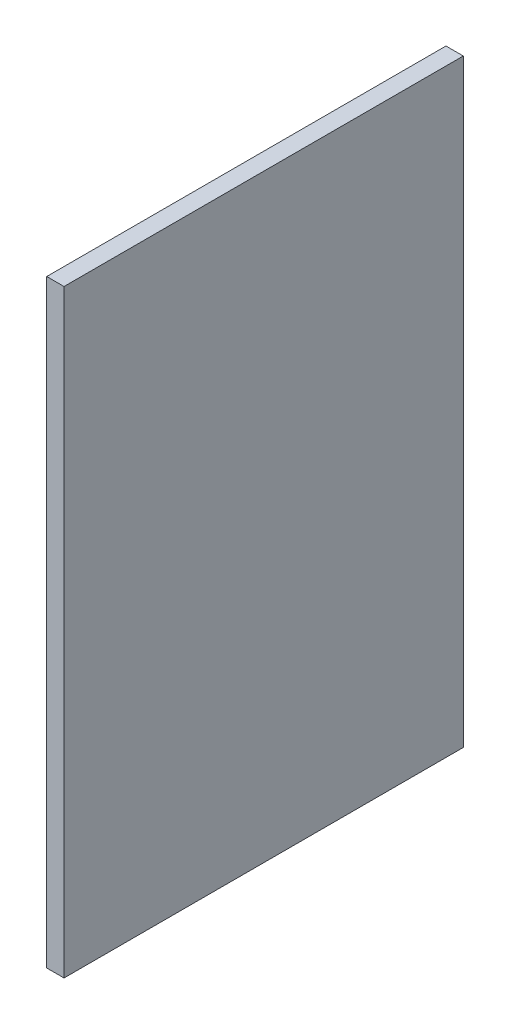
ISO-10303-21;
HEADER;
FILE_DESCRIPTION(('STEP AP214'),'2;1');
FILE_NAME('part.step','',(''),(''),'','','');
FILE_SCHEMA(('AUTOMOTIVE_DESIGN { 1 0 10303 214 1 1 1 1 }'));
ENDSEC;
DATA;
#1=APPLICATION_CONTEXT('core data for automotive mechanical design processes');
#2=APPLICATION_PROTOCOL_DEFINITION('international standard','automotive_design',2000,#1);
#3=PRODUCT_CONTEXT('',#1,'mechanical');
#4=PRODUCT('Part','Part','',(#3));
#5=PRODUCT_RELATED_PRODUCT_CATEGORY('part','',(#4));
#6=PRODUCT_DEFINITION_FORMATION('','',#4);
#7=PRODUCT_DEFINITION_CONTEXT('part definition',#1,'design');
#8=PRODUCT_DEFINITION('design','',#6,#7);
#9=PRODUCT_DEFINITION_SHAPE('','',#8);
#10=(LENGTH_UNIT() NAMED_UNIT(*) SI_UNIT(.MILLI.,.METRE.));
#11=(NAMED_UNIT(*) PLANE_ANGLE_UNIT() SI_UNIT($,.RADIAN.));
#12=(NAMED_UNIT(*) SI_UNIT($,.STERADIAN.) SOLID_ANGLE_UNIT());
#13=UNCERTAINTY_MEASURE_WITH_UNIT(LENGTH_MEASURE(1.E-05),#10,'distance_accuracy_value','');
#14=(GEOMETRIC_REPRESENTATION_CONTEXT(3) GLOBAL_UNCERTAINTY_ASSIGNED_CONTEXT((#13)) GLOBAL_UNIT_ASSIGNED_CONTEXT((#10,
#11,#12)) REPRESENTATION_CONTEXT('',''));
#15=CARTESIAN_POINT('',(0.,0.,0.));
#16=DIRECTION('',(0.,0.,1.));
#17=DIRECTION('',(1.,0.,0.));
#18=AXIS2_PLACEMENT_3D('',#15,#16,#17);
#19=CARTESIAN_POINT('',(3.302,82.55,0.));
#20=DIRECTION('',(0.,0.,-1.));
#21=DIRECTION('',(1.,0.,0.));
#22=AXIS2_PLACEMENT_3D('',#19,#20,#21);
#23=PLANE('',#22);
#24=DIRECTION('',(0.,1.,0.));
#25=VECTOR('',#24,1.);
#26=CARTESIAN_POINT('',(0.,82.55,0.));
#27=LINE('',#26,#25);
#28=CARTESIAN_POINT('',(0.,-31.75,0.));
#29=VERTEX_POINT('',#28);
#30=CARTESIAN_POINT('',(0.,82.55,0.));
#31=VERTEX_POINT('',#30);
#32=EDGE_CURVE('E98',#29,#31,#27,.T.);
#33=ORIENTED_EDGE('',*,*,#32,.F.);
#34=DIRECTION('',(-1.,0.,0.));
#35=VECTOR('',#34,1.);
#36=CARTESIAN_POINT('',(3.302,-31.75,0.));
#37=LINE('',#36,#35);
#38=CARTESIAN_POINT('',(3.302,-31.75,0.));
#39=VERTEX_POINT('',#38);
#40=EDGE_CURVE('E97',#39,#29,#37,.T.);
#41=ORIENTED_EDGE('',*,*,#40,.F.);
#42=DIRECTION('',(0.,1.,0.));
#43=VECTOR('',#42,1.);
#44=CARTESIAN_POINT('',(3.302,82.55,0.));
#45=LINE('',#44,#43);
#46=CARTESIAN_POINT('',(3.302,82.55,0.));
#47=VERTEX_POINT('',#46);
#48=EDGE_CURVE('E92',#39,#47,#45,.T.);
#49=ORIENTED_EDGE('',*,*,#48,.T.);
#50=DIRECTION('',(-1.,0.,0.));
#51=VECTOR('',#50,1.);
#52=CARTESIAN_POINT('',(3.302,82.55,0.));
#53=LINE('',#52,#51);
#54=EDGE_CURVE('E11',#47,#31,#53,.T.);
#55=ORIENTED_EDGE('',*,*,#54,.T.);
#56=EDGE_LOOP('',(#33,#41,#49,#55));
#57=FACE_BOUND('',#56,.T.);
#58=ADVANCED_FACE('F35',(#57),#23,.F.);
#59=CARTESIAN_POINT('',(3.302,82.55,0.));
#60=DIRECTION('',(0.,-1.,0.));
#61=DIRECTION('',(0.,0.,1.));
#62=AXIS2_PLACEMENT_3D('',#59,#60,#61);
#63=PLANE('',#62);
#64=DIRECTION('',(0.,0.,-1.));
#65=VECTOR('',#64,1.);
#66=CARTESIAN_POINT('',(0.,82.55,0.));
#67=LINE('',#66,#65);
#68=CARTESIAN_POINT('',(0.,82.55,-76.2));
#69=VERTEX_POINT('',#68);
#70=EDGE_CURVE('E100',#31,#69,#67,.T.);
#71=ORIENTED_EDGE('',*,*,#70,.F.);
#72=ORIENTED_EDGE('',*,*,#54,.F.);
#73=DIRECTION('',(0.,0.,-1.));
#74=VECTOR('',#73,1.);
#75=CARTESIAN_POINT('',(3.302,82.55,0.));
#76=LINE('',#75,#74);
#77=CARTESIAN_POINT('',(3.302,82.55,-76.2));
#78=VERTEX_POINT('',#77);
#79=EDGE_CURVE('E76',#47,#78,#76,.T.);
#80=ORIENTED_EDGE('',*,*,#79,.T.);
#81=DIRECTION('',(-1.,0.,0.));
#82=VECTOR('',#81,1.);
#83=CARTESIAN_POINT('',(3.302,82.55,-76.2));
#84=LINE('',#83,#82);
#85=EDGE_CURVE('E43',#78,#69,#84,.T.);
#86=ORIENTED_EDGE('',*,*,#85,.T.);
#87=EDGE_LOOP('',(#71,#72,#80,#86));
#88=FACE_BOUND('',#87,.T.);
#89=ADVANCED_FACE('F90',(#88),#63,.F.);
#90=CARTESIAN_POINT('',(3.302,82.55,-76.2));
#91=DIRECTION('',(0.,0.,1.));
#92=DIRECTION('',(0.,1.,0.));
#93=AXIS2_PLACEMENT_3D('',#90,#91,#92);
#94=PLANE('',#93);
#95=DIRECTION('',(0.,-1.,0.));
#96=VECTOR('',#95,1.);
#97=CARTESIAN_POINT('',(0.,82.55,-76.2));
#98=LINE('',#97,#96);
#99=CARTESIAN_POINT('',(0.,-31.75,-76.2));
#100=VERTEX_POINT('',#99);
#101=EDGE_CURVE('E86',#69,#100,#98,.T.);
#102=ORIENTED_EDGE('',*,*,#101,.F.);
#103=ORIENTED_EDGE('',*,*,#85,.F.);
#104=DIRECTION('',(0.,-1.,0.));
#105=VECTOR('',#104,1.);
#106=CARTESIAN_POINT('',(3.302,82.55,-76.2));
#107=LINE('',#106,#105);
#108=CARTESIAN_POINT('',(3.302,-31.75,-76.2));
#109=VERTEX_POINT('',#108);
#110=EDGE_CURVE('E79',#78,#109,#107,.T.);
#111=ORIENTED_EDGE('',*,*,#110,.T.);
#112=DIRECTION('',(-1.,0.,0.));
#113=VECTOR('',#112,1.);
#114=CARTESIAN_POINT('',(3.302,-31.75,-76.2));
#115=LINE('',#114,#113);
#116=EDGE_CURVE('E89',#109,#100,#115,.T.);
#117=ORIENTED_EDGE('',*,*,#116,.T.);
#118=EDGE_LOOP('',(#102,#103,#111,#117));
#119=FACE_BOUND('',#118,.T.);
#120=ADVANCED_FACE('F85',(#119),#94,.F.);
#121=CARTESIAN_POINT('',(3.302,-31.75,0.));
#122=DIRECTION('',(0.,1.,0.));
#123=DIRECTION('',(0.,0.,-1.));
#124=AXIS2_PLACEMENT_3D('',#121,#122,#123);
#125=PLANE('',#124);
#126=DIRECTION('',(0.,0.,1.));
#127=VECTOR('',#126,1.);
#128=CARTESIAN_POINT('',(0.,-31.75,0.));
#129=LINE('',#128,#127);
#130=EDGE_CURVE('E65',#100,#29,#129,.T.);
#131=ORIENTED_EDGE('',*,*,#130,.F.);
#132=ORIENTED_EDGE('',*,*,#116,.F.);
#133=DIRECTION('',(0.,0.,1.));
#134=VECTOR('',#133,1.);
#135=CARTESIAN_POINT('',(3.302,-31.75,0.));
#136=LINE('',#135,#134);
#137=EDGE_CURVE('E51',#109,#39,#136,.T.);
#138=ORIENTED_EDGE('',*,*,#137,.T.);
#139=ORIENTED_EDGE('',*,*,#40,.T.);
#140=EDGE_LOOP('',(#131,#132,#138,#139));
#141=FACE_BOUND('',#140,.T.);
#142=ADVANCED_FACE('F109',(#141),#125,.F.);
#143=CARTESIAN_POINT('',(3.302,0.,0.));
#144=DIRECTION('',(-1.,0.,0.));
#145=DIRECTION('',(0.,0.,-1.));
#146=AXIS2_PLACEMENT_3D('',#143,#144,#145);
#147=PLANE('',#146);
#148=ORIENTED_EDGE('',*,*,#48,.F.);
#149=ORIENTED_EDGE('',*,*,#137,.F.);
#150=ORIENTED_EDGE('',*,*,#110,.F.);
#151=ORIENTED_EDGE('',*,*,#79,.F.);
#152=EDGE_LOOP('',(#148,#149,#150,#151));
#153=FACE_BOUND('',#152,.T.);
#154=ADVANCED_FACE('F81',(#153),#147,.F.);
#155=CARTESIAN_POINT('',(0.,0.,0.));
#156=DIRECTION('',(-1.,0.,0.));
#157=DIRECTION('',(0.,0.,-1.));
#158=AXIS2_PLACEMENT_3D('',#155,#156,#157);
#159=PLANE('',#158);
#160=ORIENTED_EDGE('',*,*,#32,.T.);
#161=ORIENTED_EDGE('',*,*,#70,.T.);
#162=ORIENTED_EDGE('',*,*,#101,.T.);
#163=ORIENTED_EDGE('',*,*,#130,.T.);
#164=EDGE_LOOP('',(#160,#161,#162,#163));
#165=FACE_BOUND('',#164,.T.);
#166=ADVANCED_FACE('F105',(#165),#159,.T.);
#167=CLOSED_SHELL('',(#58,#89,#120,#142,#154,#166));
#168=MANIFOLD_SOLID_BREP('B2',#167);
#169=ADVANCED_BREP_SHAPE_REPRESENTATION('',(#18,#168),#14);
#170=SHAPE_DEFINITION_REPRESENTATION(#9,#169);
ENDSEC;
END-ISO-10303-21;
